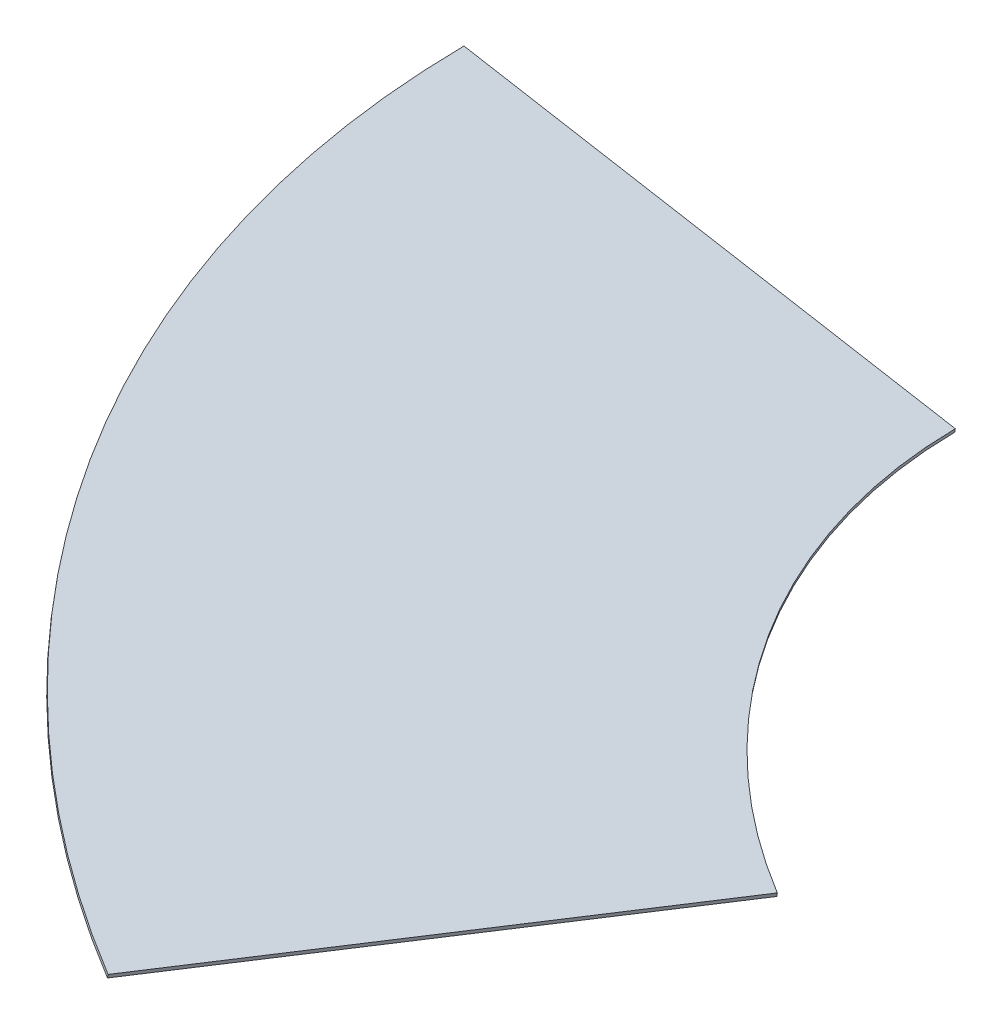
ISO-10303-21;
HEADER;
FILE_DESCRIPTION(('STEP AP214'),'2;1');
FILE_NAME('part.step','',(''),(''),'','','');
FILE_SCHEMA(('AUTOMOTIVE_DESIGN { 1 0 10303 214 1 1 1 1 }'));
ENDSEC;
DATA;
#1=APPLICATION_CONTEXT('core data for automotive mechanical design processes');
#2=APPLICATION_PROTOCOL_DEFINITION('international standard','automotive_design',2000,#1);
#3=PRODUCT_CONTEXT('',#1,'mechanical');
#4=PRODUCT('Part','Part','',(#3));
#5=PRODUCT_RELATED_PRODUCT_CATEGORY('part','',(#4));
#6=PRODUCT_DEFINITION_FORMATION('','',#4);
#7=PRODUCT_DEFINITION_CONTEXT('part definition',#1,'design');
#8=PRODUCT_DEFINITION('design','',#6,#7);
#9=PRODUCT_DEFINITION_SHAPE('','',#8);
#10=(LENGTH_UNIT() NAMED_UNIT(*) SI_UNIT(.MILLI.,.METRE.));
#11=(NAMED_UNIT(*) PLANE_ANGLE_UNIT() SI_UNIT($,.RADIAN.));
#12=(NAMED_UNIT(*) SI_UNIT($,.STERADIAN.) SOLID_ANGLE_UNIT());
#13=UNCERTAINTY_MEASURE_WITH_UNIT(LENGTH_MEASURE(1.E-05),#10,'distance_accuracy_value','');
#14=(GEOMETRIC_REPRESENTATION_CONTEXT(3) GLOBAL_UNCERTAINTY_ASSIGNED_CONTEXT((#13)) GLOBAL_UNIT_ASSIGNED_CONTEXT((#10,
#11,#12)) REPRESENTATION_CONTEXT('',''));
#15=CARTESIAN_POINT('',(0.,0.,0.));
#16=DIRECTION('',(0.,0.,1.));
#17=DIRECTION('',(1.,0.,0.));
#18=AXIS2_PLACEMENT_3D('',#15,#16,#17);
#19=CARTESIAN_POINT('',(-0.17364817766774,49.0133258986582,0.427732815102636));
#20=DIRECTION('',(0.,0.0087265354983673,-0.999961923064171));
#21=DIRECTION('',(0.984807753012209,-0.173641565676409,-0.00151534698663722));
#22=AXIS2_PLACEMENT_3D('',#19,#20,#21);
#23=PLANE('',#22);
#24=DIRECTION('',(-0.173648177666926,-0.984770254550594,-0.00859395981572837));
#25=VECTOR('',#24,1.);
#26=CARTESIAN_POINT('',(-0.17364817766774,49.0133258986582,0.427732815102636));
#27=LINE('',#26,#25);
#28=CARTESIAN_POINT('',(-8.77265670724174E-13,49.9980961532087,0.436326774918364));
#29=VERTEX_POINT('',#28);
#30=CARTESIAN_POINT('',(-0.17364817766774,49.0133258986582,0.427732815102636));
#31=VERTEX_POINT('',#30);
#32=EDGE_CURVE('E12',#29,#31,#27,.T.);
#33=ORIENTED_EDGE('',*,*,#32,.F.);
#34=DIRECTION('',(0.984807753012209,-0.173641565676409,-0.00151534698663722));
#35=VECTOR('',#34,1.);
#36=CARTESIAN_POINT('',(-8.15699504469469E-13,49.9980961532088,0.436326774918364));
#37=LINE('',#36,#35);
#38=CARTESIAN_POINT('',(141.782045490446,24.9990480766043,0.218163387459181));
#39=VERTEX_POINT('',#38);
#40=EDGE_CURVE('E70',#29,#39,#37,.T.);
#41=ORIENTED_EDGE('',*,*,#40,.T.);
#42=DIRECTION('',(-0.173648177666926,-0.984770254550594,-0.00859395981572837));
#43=VECTOR('',#42,1.);
#44=CARTESIAN_POINT('',(141.608397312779,24.0142778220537,0.209569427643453));
#45=LINE('',#44,#43);
#46=CARTESIAN_POINT('',(141.608397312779,24.0142778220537,0.209569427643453));
#47=VERTEX_POINT('',#46);
#48=EDGE_CURVE('E44',#39,#47,#45,.T.);
#49=ORIENTED_EDGE('',*,*,#48,.T.);
#50=DIRECTION('',(0.984807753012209,-0.173641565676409,-0.00151534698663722));
#51=VECTOR('',#50,1.);
#52=CARTESIAN_POINT('',(-0.17364817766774,49.0133258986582,0.427732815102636));
#53=LINE('',#52,#51);
#54=EDGE_CURVE('E73',#31,#47,#53,.T.);
#55=ORIENTED_EDGE('',*,*,#54,.F.);
#56=EDGE_LOOP('',(#33,#41,#49,#55));
#57=FACE_BOUND('',#56,.T.);
#58=ADVANCED_FACE('F34',(#57),#23,.T.);
#59=CARTESIAN_POINT('',(283.390442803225,-0.984770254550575,-0.00859395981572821));
#60=DIRECTION('',(0.173648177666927,0.984770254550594,0.0085939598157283));
#61=DIRECTION('',(-0.984806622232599,0.173654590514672,0.));
#62=AXIS2_PLACEMENT_3D('',#59,#60,#61);
#63=CYLINDRICAL_SURFACE('',#62,143.969262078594);
#64=ORIENTED_EDGE('',*,*,#48,.F.);
#65=CARTESIAN_POINT('',(283.564090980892,0.,0.));
#66=DIRECTION('',(0.173648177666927,0.984770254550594,0.0085939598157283));
#67=DIRECTION('',(-0.984806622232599,0.173654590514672,0.));
#68=AXIS2_PLACEMENT_3D('',#65,#66,#67);
#69=CIRCLE('',#68,143.969262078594);
#70=CARTESIAN_POINT('',(217.744822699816,10.4924997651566,127.612224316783));
#71=VERTEX_POINT('',#70);
#72=EDGE_CURVE('E85',#39,#71,#69,.T.);
#73=ORIENTED_EDGE('',*,*,#72,.T.);
#74=DIRECTION('',(-0.173648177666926,-0.984770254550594,-0.00859395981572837));
#75=VECTOR('',#74,1.);
#76=CARTESIAN_POINT('',(217.571174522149,9.50772951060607,127.603630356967));
#77=LINE('',#76,#75);
#78=CARTESIAN_POINT('',(217.571174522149,9.50772951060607,127.603630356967));
#79=VERTEX_POINT('',#78);
#80=EDGE_CURVE('E94',#71,#79,#77,.T.);
#81=ORIENTED_EDGE('',*,*,#80,.T.);
#82=CARTESIAN_POINT('',(283.390442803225,-0.984770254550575,-0.00859395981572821));
#83=DIRECTION('',(0.173648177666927,0.984770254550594,0.0085939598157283));
#84=DIRECTION('',(-0.984806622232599,0.173654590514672,0.));
#85=AXIS2_PLACEMENT_3D('',#82,#83,#84);
#86=CIRCLE('',#85,143.969262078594);
#87=EDGE_CURVE('E89',#47,#79,#86,.T.);
#88=ORIENTED_EDGE('',*,*,#87,.F.);
#89=EDGE_LOOP('',(#64,#73,#81,#88));
#90=FACE_BOUND('',#89,.T.);
#91=ADVANCED_FACE('F102',(#90),#63,.F.);
#92=CARTESIAN_POINT('',(217.571174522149,9.50772951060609,127.603630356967));
#93=DIRECTION('',(0.872259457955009,-0.157848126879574,0.462868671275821));
#94=DIRECTION('',(-0.457175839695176,0.0728801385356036,0.886385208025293));
#95=AXIS2_PLACEMENT_3D('',#92,#93,#94);
#96=PLANE('',#95);
#97=ORIENTED_EDGE('',*,*,#80,.F.);
#98=DIRECTION('',(-0.457175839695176,0.0728801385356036,0.886385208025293));
#99=VECTOR('',#98,1.);
#100=CARTESIAN_POINT('',(217.744822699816,10.4924997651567,127.612224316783));
#101=LINE('',#100,#99);
#102=CARTESIAN_POINT('',(151.925554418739,20.9849995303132,255.224448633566));
#103=VERTEX_POINT('',#102);
#104=EDGE_CURVE('E87',#71,#103,#101,.T.);
#105=ORIENTED_EDGE('',*,*,#104,.T.);
#106=DIRECTION('',(-0.173648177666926,-0.984770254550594,-0.00859395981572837));
#107=VECTOR('',#106,1.);
#108=CARTESIAN_POINT('',(151.751906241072,20.0002292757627,255.21585467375));
#109=LINE('',#108,#107);
#110=CARTESIAN_POINT('',(151.751906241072,20.0002292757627,255.21585467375));
#111=VERTEX_POINT('',#110);
#112=EDGE_CURVE('E38',#103,#111,#109,.T.);
#113=ORIENTED_EDGE('',*,*,#112,.T.);
#114=DIRECTION('',(-0.457175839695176,0.0728801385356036,0.886385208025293));
#115=VECTOR('',#114,1.);
#116=CARTESIAN_POINT('',(217.571174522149,9.50772951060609,127.603630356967));
#117=LINE('',#116,#115);
#118=EDGE_CURVE('E103',#79,#111,#117,.T.);
#119=ORIENTED_EDGE('',*,*,#118,.F.);
#120=EDGE_LOOP('',(#97,#105,#113,#119));
#121=FACE_BOUND('',#120,.T.);
#122=ADVANCED_FACE('F107',(#121),#96,.T.);
#123=CARTESIAN_POINT('',(283.390442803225,-0.984770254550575,-0.00859395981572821));
#124=DIRECTION('',(-0.173648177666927,-0.984770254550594,-0.00859395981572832));
#125=DIRECTION('',(0.984806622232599,-0.173654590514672,0.));
#126=AXIS2_PLACEMENT_3D('',#123,#124,#125);
#127=CYLINDRICAL_SURFACE('',#126,287.938524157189);
#128=CARTESIAN_POINT('',(283.564090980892,0.,0.));
#129=DIRECTION('',(-0.173648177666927,-0.984770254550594,-0.00859395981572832));
#130=DIRECTION('',(0.984806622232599,-0.173654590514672,0.));
#131=AXIS2_PLACEMENT_3D('',#128,#129,#130);
#132=CIRCLE('',#131,287.938524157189);
#133=EDGE_CURVE('E83',#103,#29,#132,.T.);
#134=ORIENTED_EDGE('',*,*,#133,.T.);
#135=ORIENTED_EDGE('',*,*,#32,.T.);
#136=CARTESIAN_POINT('',(283.390442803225,-0.984770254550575,-0.00859395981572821));
#137=DIRECTION('',(-0.173648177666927,-0.984770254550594,-0.00859395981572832));
#138=DIRECTION('',(0.984806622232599,-0.173654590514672,0.));
#139=AXIS2_PLACEMENT_3D('',#136,#137,#138);
#140=CIRCLE('',#139,287.938524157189);
#141=EDGE_CURVE('E101',#111,#31,#140,.T.);
#142=ORIENTED_EDGE('',*,*,#141,.F.);
#143=ORIENTED_EDGE('',*,*,#112,.F.);
#144=EDGE_LOOP('',(#134,#135,#142,#143));
#145=FACE_BOUND('',#144,.T.);
#146=ADVANCED_FACE('F36',(#145),#127,.T.);
#147=CARTESIAN_POINT('',(277.805320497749,0.,0.));
#148=DIRECTION('',(-0.173648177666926,-0.984770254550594,-0.00859395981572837));
#149=DIRECTION('',(0.984806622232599,-0.173654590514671,0.));
#150=AXIS2_PLACEMENT_3D('',#147,#148,#149);
#151=PLANE('',#150);
#152=ORIENTED_EDGE('',*,*,#118,.T.);
#153=ORIENTED_EDGE('',*,*,#141,.T.);
#154=ORIENTED_EDGE('',*,*,#54,.T.);
#155=ORIENTED_EDGE('',*,*,#87,.T.);
#156=EDGE_LOOP('',(#152,#153,#154,#155));
#157=FACE_BOUND('',#156,.T.);
#158=ADVANCED_FACE('F100',(#157),#151,.T.);
#159=CARTESIAN_POINT('',(277.978968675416,0.984770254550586,0.0085939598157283));
#160=DIRECTION('',(-0.173648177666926,-0.984770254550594,-0.00859395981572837));
#161=DIRECTION('',(0.984806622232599,-0.173654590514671,0.));
#162=AXIS2_PLACEMENT_3D('',#159,#160,#161);
#163=PLANE('',#162);
#164=ORIENTED_EDGE('',*,*,#104,.F.);
#165=ORIENTED_EDGE('',*,*,#72,.F.);
#166=ORIENTED_EDGE('',*,*,#40,.F.);
#167=ORIENTED_EDGE('',*,*,#133,.F.);
#168=EDGE_LOOP('',(#164,#165,#166,#167));
#169=FACE_BOUND('',#168,.T.);
#170=ADVANCED_FACE('F82',(#169),#163,.F.);
#171=CLOSED_SHELL('',(#58,#91,#122,#146,#158,#170));
#172=MANIFOLD_SOLID_BREP('B2',#171);
#173=ADVANCED_BREP_SHAPE_REPRESENTATION('',(#18,#172),#14);
#174=SHAPE_DEFINITION_REPRESENTATION(#9,#173);
ENDSEC;
END-ISO-10303-21;
